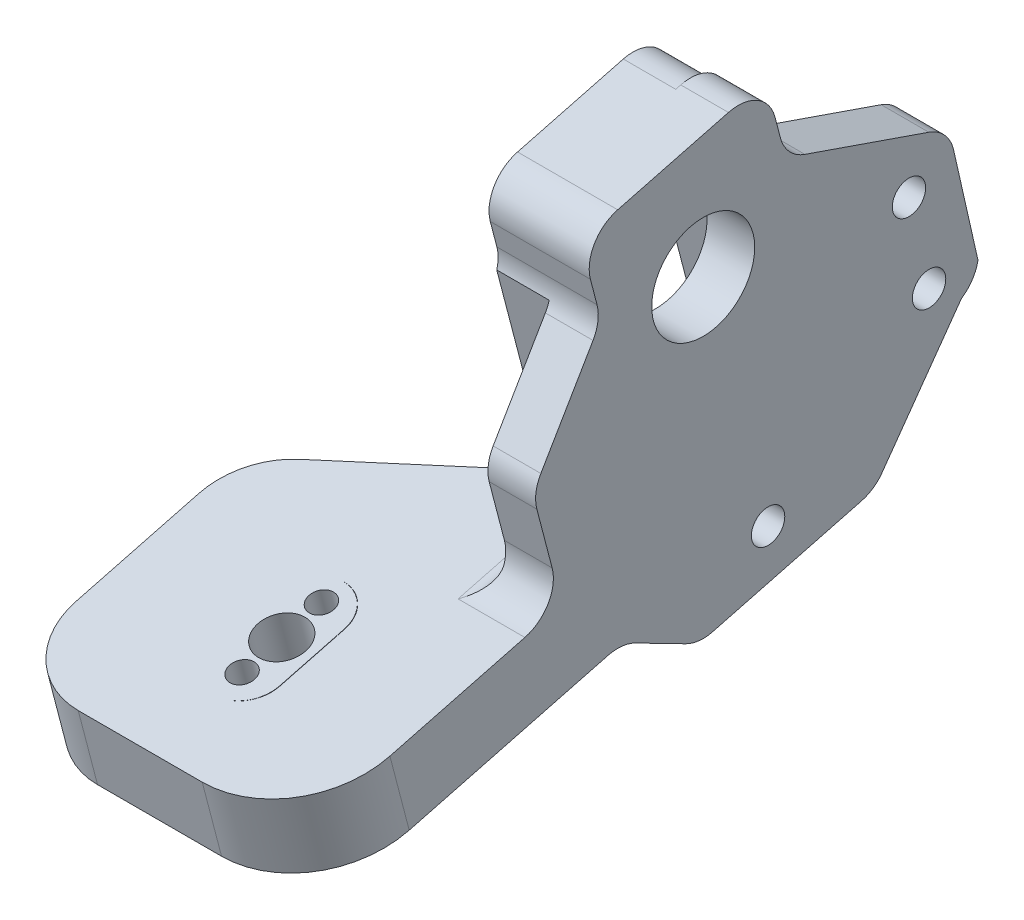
from build123d import *

# Parameters (mm, degrees)
SKETCH1_R           = 5.3999999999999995
SKETCH1_R_2         = 1.7500000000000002
SKETCH1_R_3         = 1.7500000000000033
BOSS_EXTRUDE1_DEPTH = 5
BOSS_EXTRUDE2_DEPTH = 10.5
BOSS_EXTRUDE3_DEPTH = 8
BOSS_EXTRUDE4_START = -3
BOSS_EXTRUDE4_DEPTH = 5
SKETCH7_R           = 2.4999999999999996
SKETCH7_R_2         = 1.3000000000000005
SKETCH7_R_3         = 1.2999999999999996
CUT_EXTRUDE2_DEPTH  = 5
FILLET1_R           = 10
FILLET5_R           = 2


with BuildPart() as part:
    # Sketch1 → Boss-Extrude1 (new body)
    with BuildSketch(Plane(origin=(0, 0, 0), x_dir=(0, 0, -1), z_dir=(1, 0, 0))):
        with BuildLine():
            Line((-32.426707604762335, -17.24998061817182), (-30.404294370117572, -24.99012562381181))
            Line((-30.404294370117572, -24.99012562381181), (-6.27025916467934, -18.68417241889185))
            ThreePointArc((-6.27025916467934, -18.68417241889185), (-4.822766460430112, -18.57810930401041), (-3.4327131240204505, -18.99552544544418))
            Line((-3.4327131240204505, -18.99552544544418), (1.855785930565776, -21.709589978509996))
            ThreePointArc((1.855785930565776, -21.709589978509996), (3.2458392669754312, -22.127006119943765), (4.6933319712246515, -22.02094300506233))
            Line((4.6933319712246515, -22.02094300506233), (20.25169442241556, -17.955717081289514))
            ThreePointArc((20.25169442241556, -17.955717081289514), (21.329791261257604, -17.49662846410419), (22.22859254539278, -16.744823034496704))
            Line((22.22859254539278, -16.744823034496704), (30.75894713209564, -4.802643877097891))
            ThreePointArc((30.75894713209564, -4.802643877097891), (31.89043162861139, -3.6788636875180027), (32.49295602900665, -2.202346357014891))
            Line((32.49295602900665, -2.202346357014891), (29.904568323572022, 9.226747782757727))
            ThreePointArc((29.904568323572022, 9.226747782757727), (28.9694945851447, 10.933220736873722), (27.33985103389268, 11.996552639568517))
            Line((27.33985103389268, 11.996552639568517), (14.346134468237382, 16.482499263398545))
            ThreePointArc((14.346134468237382, 16.482499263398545), (12.716490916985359, 17.545831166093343), (11.781417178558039, 19.25230412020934))
            Line((11.781417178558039, 19.25230412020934), (11.21027125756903, 21.438183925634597))
            ThreePointArc((11.21027125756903, 21.438183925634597), (9.361722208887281, 23.878562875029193), (6.328992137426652, 24.29704981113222))
            Line((6.328992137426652, 24.29704981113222), (-5.2812253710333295, 21.263429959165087))
            ThreePointArc((-5.2812253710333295, 21.263429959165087), (-7.721604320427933, 19.414880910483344), (-8.140091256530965, 16.38215083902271))
            Line((-8.140091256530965, 16.38215083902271), (-7.446619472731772, 13.728107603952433))
            ThreePointArc((-7.446619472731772, 13.728107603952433), (-7.354239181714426, 12.170121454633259), (-7.865106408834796, 10.695377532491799))
            Line((-7.865106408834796, 10.695377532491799), (-13.337586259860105, 1.3515668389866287))
            ThreePointArc((-13.337586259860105, 1.3515668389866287), (-13.848453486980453, -0.12317708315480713), (-13.756073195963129, -1.6811632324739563))
            Line((-13.756073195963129, -1.6811632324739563), (-12.152515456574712, -7.818271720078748))
            ThreePointArc((-12.152515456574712, -7.818271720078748), (-12.571002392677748, -10.851001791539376), (-15.011381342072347, -12.699550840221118))
            Line((-15.011381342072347, -12.699550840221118), (-32.426707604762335, -17.24998061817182))
        make_face()
        with Locations((3.683904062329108, 10.686263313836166)):
            Circle(SKETCH1_R, mode=Mode.SUBTRACT)
        with Locations((25.25426188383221, 7.123562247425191)):
            Circle(SKETCH1_R_2, mode=Mode.SUBTRACT)
        with Locations((27.363289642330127, -2.2157477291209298)):
            Circle(SKETCH1_R_2, mode=Mode.SUBTRACT)
        with Locations((10.484268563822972, -15.339974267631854)):
            Circle(SKETCH1_R_3, mode=Mode.SUBTRACT)
    extrude(amount=-BOSS_EXTRUDE1_DEPTH)

    # Sketch4 → Boss-Extrude2 (add)
    with BuildSketch(Plane(origin=(0, 0, 0), x_dir=(0, 0, -1), z_dir=(1, 0, 0))):
        with BuildLine():
            ThreePointArc((14.65326029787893, -9.70294498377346), (17.09363924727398, -7.8543959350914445), (17.5121261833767, -4.821665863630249))
            Line((17.5121261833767, -4.82166586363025), (10.686481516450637, 21.301323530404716))
            ThreePointArc((10.686481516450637, 21.301323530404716), (8.837932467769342, 23.741702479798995), (5.805202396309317, 24.160189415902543))
            Line((5.805202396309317, 24.160189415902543), (-5.281225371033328, 21.263429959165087))
            ThreePointArc((-5.2812253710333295, 21.263429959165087), (-7.721604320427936, 19.41488091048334), (-8.140091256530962, 16.38215083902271))
            Line((-8.140091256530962, 16.38215083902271), (-7.446619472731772, 13.728107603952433))
            ThreePointArc((-7.446619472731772, 13.728107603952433), (-7.3168072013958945, 12.686539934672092), (-7.462415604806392, 11.647062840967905))
            Line((-7.462415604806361, 11.647062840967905), (-3.0011239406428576, -5.427115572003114))
            Line((-3.0011239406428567, -5.427115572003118), (0.03249591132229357, -17.037333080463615))
            ThreePointArc((0.03249591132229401, -17.037333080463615), (0.7206994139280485, -14.342676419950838), (2.999256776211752, -12.748005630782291))
            Line((2.999256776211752, -12.748005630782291), (14.65326029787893, -9.70294498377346))
        make_face()
        Polygon((-4.771964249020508, 15.195059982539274), (7.805771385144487, 18.481481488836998), (13.620209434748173, -3.7714354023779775), (1.0424738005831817, -7.057856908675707), align=None, mode=Mode.SUBTRACT)
    extrude(amount=-BOSS_EXTRUDE2_DEPTH)

    # Sketch5 → Boss-Extrude3 (add)
    with BuildSketch(Plane(origin=(0, -15.956447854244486, -4.169241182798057), x_dir=(1, 0, 0), z_dir=(0, -0.9675181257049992, -0.25280165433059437))):
        with BuildLine():
            Line((-10.5, 4.275625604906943), (-27.09583555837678, 14.167068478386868))
            ThreePointArc((-27.09583555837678, 14.167068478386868), (-29.955813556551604, 17.087258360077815), (-31, 21.03905007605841))
            Line((-31, 21.03905007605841), (-31, 34.35905007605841))
            ThreePointArc((-31, 34.35905007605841), (-28.65685424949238, 40.01590432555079), (-23, 42.3590500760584))
            Line((-23, 42.3590500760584), (-15, 42.359050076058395))
            Line((-15, 42.359050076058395), (0, 42.359050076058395))
            Line((0, 42.359050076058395), (0, 35.73425100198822))
            Line((0, 35.73425100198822), (-5, 35.73425100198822))
            Line((-5, 35.73425100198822), (-5.000000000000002, 4.275625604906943))
            Line((-5.000000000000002, 4.275625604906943), (-10.5, 4.275625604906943))
        make_face()
        with BuildLine():
            Line((-18.999999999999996, 24.85905007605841), (-19, 31.859050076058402))
            ThreePointArc((-19, 31.859050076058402), (-15.500000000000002, 35.35905007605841), (-11.999999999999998, 31.859050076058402))
            Line((-11.999999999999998, 31.859050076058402), (-11.999999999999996, 24.85905007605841))
            ThreePointArc((-11.999999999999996, 24.85905007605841), (-15.499999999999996, 21.35905007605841), (-18.999999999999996, 24.85905007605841))
        make_face(mode=Mode.SUBTRACT)
    extrude(amount=-BOSS_EXTRUDE3_DEPTH)

    # Sketch6 → Boss-Extrude4 (add)
    with BuildSketch(Plane(origin=(0, -15.956447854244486, -4.169241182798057), x_dir=(1, 0, 0), z_dir=(0, -0.9675181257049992, -0.25280165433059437)).offset(BOSS_EXTRUDE4_START)):
        with BuildLine():
            Line((-12.031519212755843, 31.865966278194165), (-12.031519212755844, 24.865966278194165))
            ThreePointArc((-12.031519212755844, 24.865966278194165), (-15.531519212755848, 21.365966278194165), (-19.031519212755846, 24.865966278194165))
            Line((-19.031519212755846, 24.865966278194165), (-19.031519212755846, 31.865966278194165))
            ThreePointArc((-19.031519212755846, 31.865966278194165), (-15.531519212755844, 35.365966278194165), (-12.031519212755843, 31.865966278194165))
        make_face()
    extrude(amount=-BOSS_EXTRUDE4_DEPTH)

    # Sketch7 → Cut-Extrude2 (cut)
    with BuildSketch(Plane(origin=(0, -13.053893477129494, -3.4108362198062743), x_dir=(1, 0, 0), z_dir=(0, -0.9675181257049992, -0.2528016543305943))):
        with Locations(Location((-15.39032021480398, 28.17261819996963, 0), (0, 0, 270))):
            Circle(SKETCH7_R)
        with Locations(Location((-15.390320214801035, 32.47261819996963, 0), (0, 0, 270))):
            Circle(SKETCH7_R_2)
        with Locations(Location((-15.39032021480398, 23.87261819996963, 0), (0, 0, 270))):
            Circle(SKETCH7_R_3)
    extrude(amount=-CUT_EXTRUDE2_DEPTH, mode=Mode.SUBTRACT)

    # Fillet1
    fillet1_edges = [part.edges().sort_by_distance(p)[0] for p in [
        (0, -22.79481328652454, 37.82511417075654),
    ]]
    fillet(fillet1_edges, radius=FILLET1_R)

    # Fillet5
    fillet5_edges = [part.edges().sort_by_distance(p)[0] for p in [
        (-5.000000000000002, -10.998369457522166, 8.500649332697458),
        (-7.750000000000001, -9.297188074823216, 1.9899173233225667),
    ]]
    fillet(fillet5_edges, radius=FILLET5_R)


solid = part.part
